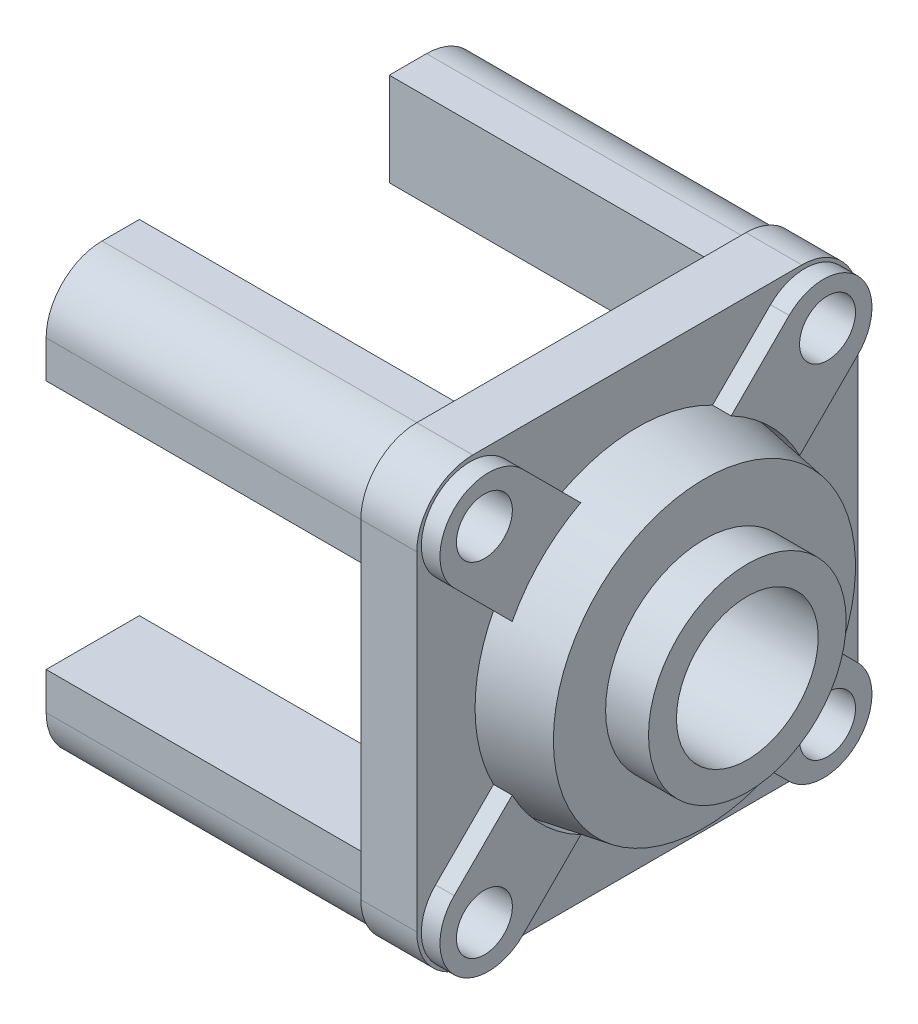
from build123d import *

# Parameters (mm, degrees)
BOSS_EXTRUDE2_START = -30
SKETCH4_W           = 236.5
SKETCH4_H           = 236.5
SKETCH4_R           = 118
BOSS_EXTRUDE2_DEPTH = 30
BOSS_EXTRUDE3_DEPTH = 10
SKETCH6_R           = 15
CUT_EXTRUDE1_DEPTH  = 175.261656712
CIRPATTERN1_COUNT   = 4
SKETCH7_W           = 50
SKETCH7_H           = 50
BOSS_EXTRUDE4_DEPTH = 170
CIRPATTERN2_COUNT   = 4
FILLET1_R           = 30


with BuildPart() as part:
    # Sketch3 → Revolve1 (revolve)
    with BuildSketch(Plane.XY, mode=Mode.PRIVATE) as revolve1_sk:
        Polygon((0, 118), (30, 118), (30, 87), (66, 81), (66, 53), (89, 53), (89, 38), (8, 38), (8, 81), (0, 81), align=None)
    revolve(revolve1_sk.sketch.rotate(Axis((0, 0, 0), (1, 0, 0)), 90), axis=Axis((0, 0, 0), (1, 0, 0)))

    # Sketch4 → Boss-Extrude2 (add)
    with BuildSketch(Plane.ZY.offset(BOSS_EXTRUDE2_START)):
        Rectangle(SKETCH4_W, SKETCH4_H)
        Circle(SKETCH4_R, mode=Mode.SUBTRACT)
    extrude(amount=BOSS_EXTRUDE2_DEPTH)

    # Sketch5 → Boss-Extrude3 (add)
    with BuildSketch(Plane(origin=(30, 0, 0), x_dir=(0, 0, -1), z_dir=(1, 0, 0))):
        with BuildLine():
            Line((108.204373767, 71.434821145), (77.091675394, 40.322122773))
            ThreePointArc((77.091675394, 40.322122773), (61.518289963, 61.518289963), (40.322122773, 77.091675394))
            Line((40.322122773, 77.091675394), (71.434821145, 108.204373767))
            ThreePointArc((71.434821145, 108.204373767), (108.204373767, 108.204373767), (108.204373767, 71.434821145))
        make_face()
    boss_extrude3 = extrude(amount=BOSS_EXTRUDE3_DEPTH)

    # Sketch6 → Cut-Extrude1 (cut, through all)
    with BuildSketch(Plane(origin=(40, 0, 0), x_dir=(0, 0, -1), z_dir=(1, 0, 0))):
        with Locations((92, 92)):
            Circle(SKETCH6_R)
    cut_extrude1 = extrude(amount=-CUT_EXTRUDE1_DEPTH, mode=Mode.SUBTRACT)

    # CirPattern1: Boss-Extrude3, Cut-Extrude1 ×4 about axis
    cirpattern1_axis = Axis((0, 0, 0), (1, 0, 0))
    add([boss_extrude3.rotate(cirpattern1_axis, i * 360 / CIRPATTERN1_COUNT) for i in range(1, CIRPATTERN1_COUNT)])
    add([cut_extrude1.rotate(cirpattern1_axis, i * 360 / CIRPATTERN1_COUNT) for i in range(1, CIRPATTERN1_COUNT)], mode=Mode.SUBTRACT)

    # Sketch7 → Boss-Extrude4 (add)
    with BuildSketch(Plane.ZY):
        with Locations((-92, 92)):
            Rectangle(SKETCH7_W, SKETCH7_H)
    boss_extrude4 = extrude(amount=BOSS_EXTRUDE4_DEPTH)

    # CirPattern2: Boss-Extrude4 ×4 about axis
    cirpattern2_axis = Axis((0, 0, 0), (1, 0, 0))
    for i in range(1, CIRPATTERN2_COUNT):
        add(boss_extrude4.rotate(cirpattern2_axis, i * 360 / CIRPATTERN2_COUNT))

    # Fillet1
    fillet1_edges = [part.edges().sort_by_distance(p)[0] for p in [
        (-85, 117, -117),
        (-85, -117, -117),
        (-85, -117, 117),
        (-85, 117, 117),
        (15, -118.25, -118.25),
        (15, 118.25, -118.25),
        (15, 118.25, 118.25),
        (15, -118.25, 118.25),
    ]]
    fillet(fillet1_edges, radius=FILLET1_R)


solid = part.part
